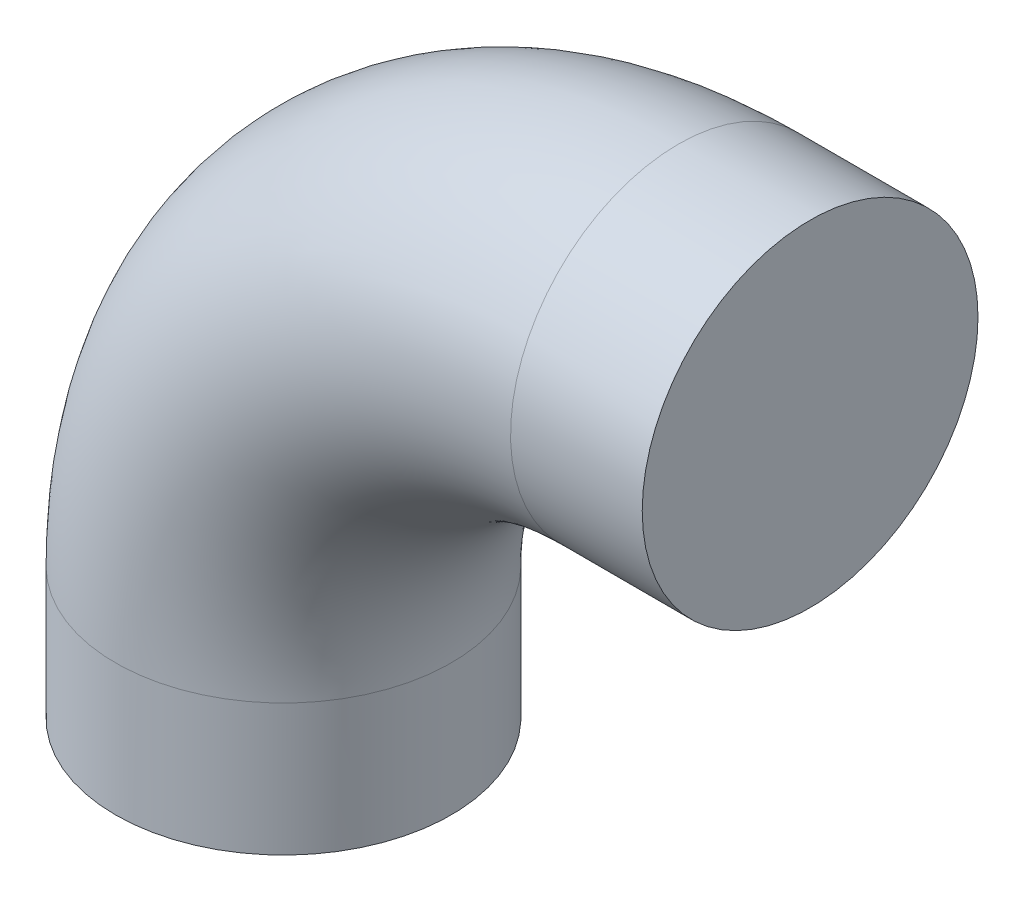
from build123d import *

# Parameters (mm, degrees)
SKETCH2_R = 0.6477


with BuildPart() as part:
    # Sweep1: sweep along a path in Sketch1
    with BuildLine(Plane.XY) as sweep1_path:
        Line((0, 0), (-0.508, 0))
        ThreePointArc((-0.508, 0), (-1.585630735, -0.446369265), (-2.032, -1.524))
        Line((-2.032, -1.524), (-2.032, -2.032))
    # Sketch2 → Sweep1 (sweep)
    with BuildSketch(Plane(origin=(0, 0, 0), x_dir=(0, 0, -1), z_dir=(1, 0, 0))):
        Circle(SKETCH2_R)
    sweep(path=sweep1_path.line)


solid = part.part
